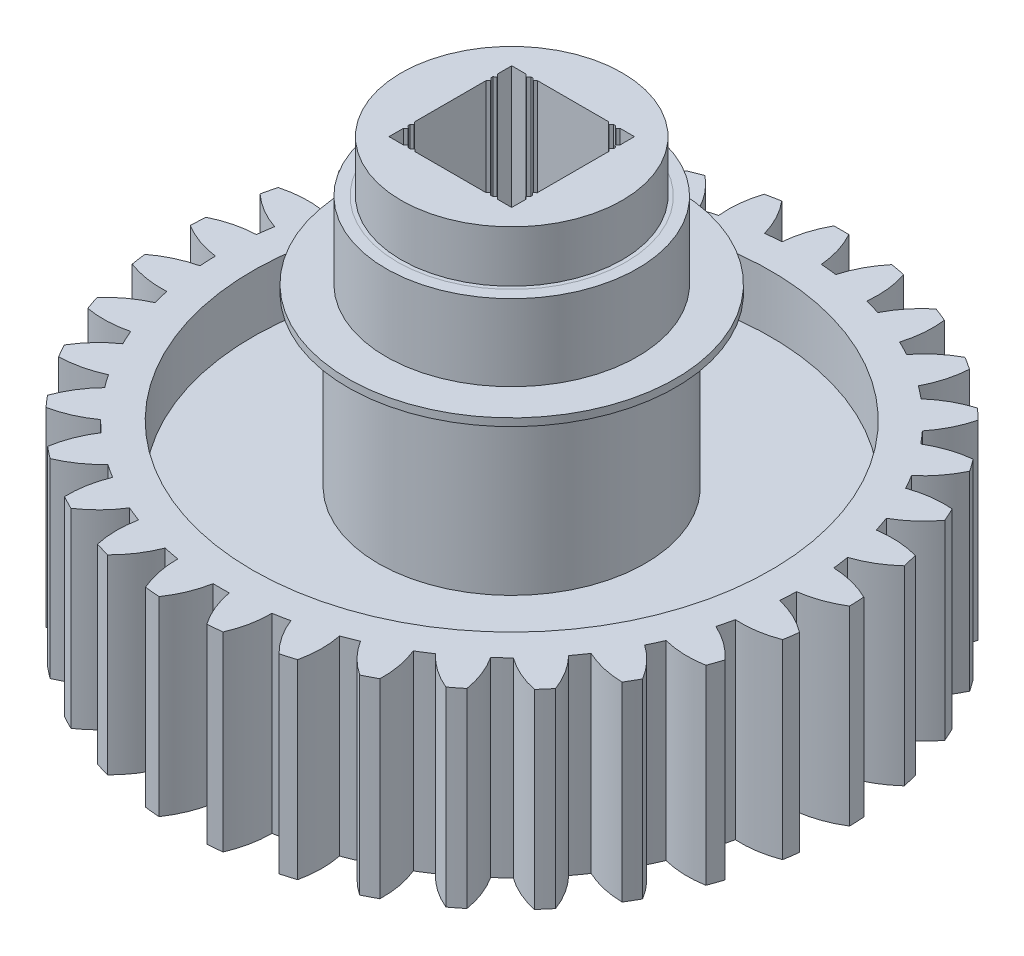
from build123d import *

# Parameters (mm, degrees)
SKETCH2_W            = 3.22
SKETCH2_H            = 3.22
CUT_EXTRUDE1_DEPTH   = 5.85
SKETCH3_R            = 1
EXTRUDE1_DEPTH       = 1.2
EXTRUDE2_DEPTH       = 5
CIRPATTERN1_COUNT    = 33
EXTRUDE3_START       = -5.85
EXTRUDE3_DEPTH       = 5.85
MIRROR2_START        = -5.85
MIRROR2_COPY_1_DEPTH = 5.85
MIRROR2_COPY_2_DEPTH = 5.85
SKETCH9_W            = 0.6
SKETCH9_H            = 1.8
CHAMFER1_SIZE        = 0.2


with BuildPart() as part:
    # Sketch1 → Revolve1 (revolve)
    with BuildSketch(Plane.XY, mode=Mode.PRIVATE) as revolve1_sk:
        Polygon((-2.3, 5.1), (-0.3, 5.1), (-0.3, 11.45), (-2.9, 11.45), (-2.9, 10.1), (-3, 10.1), (-3, 7.9), (-3.5, 7.9), (-3.5, 3.5), (-6.8, 3.5), (-6.8, 5), (-7.57, 5), (-7.57, 0), (-6.8, 0), (-6.8, 1.5), (-6, 1.5), (-6, -1.1), (-5, -1.1), (-5, 2.3), (-2.3, 2.3), align=None)
    revolve(revolve1_sk.sketch.rotate(Axis((0, 12.83176501, 0), (0, -1, 0)), 270), axis=Axis((0, 12.83176501, 0), (0, -1, 0)))

    # Sketch2 → Cut-Extrude1 (cut)
    with BuildSketch(Plane(origin=(0, 11.45, 0), x_dir=(1, 0, 0), z_dir=(0, 1, 0))):
        Rectangle(SKETCH2_W, SKETCH2_H)
    extrude(amount=-CUT_EXTRUDE1_DEPTH, mode=Mode.SUBTRACT)

    # Sketch3 → Extrude1 (add)
    with BuildSketch(Plane.XZ.offset(-2.3)):
        with Locations(Location((0, -3.4, 0), (0, 0, 270))):
            Circle(SKETCH3_R)
        with Locations(Location((0, 3.4, 0), (0, 0, 90))):
            Circle(SKETCH3_R)
        with BuildLine():
            Line((3, 3.322649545), (3, 4))
            ThreePointArc((3, 4), (5, 0), (3, -4))
            Line((3, -4), (3, -3.322649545))
            ThreePointArc((3, -3.322649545), (3.059460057, -2.982966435), (3.230769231, -2.683678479))
            ThreePointArc((3.230769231, -2.683678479), (4.2, 0), (3.230769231, 2.683678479))
            ThreePointArc((3.230769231, 2.683678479), (3.059460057, 2.982966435), (3, 3.322649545))
        make_face()
        with BuildLine():
            Line((-3, -4), (-3, -3.322649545))
            ThreePointArc((-3, -3.322649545), (-3.059460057, -2.982966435), (-3.230769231, -2.683678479))
            ThreePointArc((-3.230769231, -2.683678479), (-4.2, 0), (-3.230769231, 2.683678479))
            ThreePointArc((-3.230769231, 2.683678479), (-3.059460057, 2.982966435), (-3, 3.322649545))
            Line((-3, 3.322649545), (-3, 4))
            ThreePointArc((-3, 4), (-5, 0), (-3, -4))
        make_face()
    extrude(amount=EXTRUDE1_DEPTH)

    # Sketch4 → Extrude2 (add)
    with BuildSketch(Plane.XZ):
        with BuildLine():
            ThreePointArc((1.220907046, 7.470895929), (-0.001289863, 7.56999989), (-1.223452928, 7.470479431))
            ThreePointArc((-1.223452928, 7.470479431), (-1.175705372, 8.043187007), (-1.003777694, 8.591561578))
            ThreePointArc((-1.003777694, 8.591561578), (-0.815403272, 8.611481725), (-0.626637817, 8.627272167))
            ThreePointArc((-0.626637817, 8.627272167), (-0.36582475, 8.146575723), (-0.210907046, 7.622082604))
            ThreePointArc((-0.210907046, 7.622082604), (0, 7.625), (0.210907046, 7.622082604))
            ThreePointArc((0.210907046, 7.622082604), (0.36582475, 8.146575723), (0.626637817, 8.627272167))
            ThreePointArc((0.626637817, 8.627272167), (0.815102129, 8.611510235), (1.003176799, 8.591631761))
            ThreePointArc((1.003176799, 8.591631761), (1.174073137, 8.04331492), (1.220907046, 7.470895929))
        make_face()
    extrude2 = extrude(amount=-EXTRUDE2_DEPTH)

    # CirPattern1: Extrude2 ×33 about axis
    cirpattern1_axis = Axis((0, 0, 0), (0, 1, 0))
    for i in range(1, CIRPATTERN1_COUNT):
        add(extrude2.rotate(cirpattern1_axis, i * 360 / CIRPATTERN1_COUNT))

    # Sketch5 → Extrude3 (add)
    with BuildSketch(Plane(origin=(0, 11.45, 0), x_dir=(-1, 0, 0), z_dir=(0, 1, 0)).offset(EXTRUDE3_START)):
        with BuildLine():
            Line((-1.61, 1.064387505), (-1.61, 0.941000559))
            Line((-1.61, 0.941000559), (-1.551302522, 0.995356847))
            ThreePointArc((-1.551302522, 0.995356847), (-1.548097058, 1.002694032), (-1.551302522, 1.010031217))
            Line((-1.551302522, 1.010031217), (-1.61, 1.064387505))
        make_face()
        with BuildLine():
            Line((-1.551302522, -0.995356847), (-1.61, -0.941000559))
            Line((-1.61, -0.941000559), (-1.61, -1.064387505))
            Line((-1.61, -1.064387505), (-1.551302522, -1.010031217))
            ThreePointArc((-1.551302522, -1.010031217), (-1.548097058, -1.002694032), (-1.551302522, -0.995356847))
        make_face()
        with BuildLine():
            Line((-1.61, 1.23), (-1.61, 1.114387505))
            Line((-1.61, 1.114387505), (-1.54755002, 1.164387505))
            ThreePointArc((-1.54755002, 1.164387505), (-1.54380002, 1.172193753), (-1.54755002, 1.18))
            Line((-1.54755002, 1.18), (-1.61, 1.23))
        make_face()
        with BuildLine():
            Line((-1.54755002, -1.164387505), (-1.61, -1.114387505))
            Line((-1.61, -1.114387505), (-1.61, -1.23))
            Line((-1.61, -1.23), (-1.54755002, -1.18))
            ThreePointArc((-1.54755002, -1.18), (-1.54380002, -1.172193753), (-1.54755002, -1.164387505))
        make_face()
        with BuildLine():
            Line((-1.1078, 1.61), (-1.2348, 1.61))
            Line((-1.2348, 1.61), (-1.180295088, 1.5553146))
            ThreePointArc((-1.180295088, 1.5553146), (-1.1713, 1.55158), (-1.162304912, 1.5553146))
            Line((-1.162304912, 1.5553146), (-1.1078, 1.61))
        make_face()
        with BuildLine():
            Line((-0.93, 1.61), (-1.057, 1.61))
            Line((-1.057, 1.61), (-1.002495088, 1.5553146))
            ThreePointArc((-1.002495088, 1.5553146), (-0.9935, 1.55158), (-0.984504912, 1.5553146))
            Line((-0.984504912, 1.5553146), (-0.93, 1.61))
        make_face()
        with BuildLine():
            Line((1.180295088, 1.5553146), (1.2348, 1.61))
            Line((1.2348, 1.61), (1.1078, 1.61))
            Line((1.1078, 1.61), (1.162304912, 1.5553146))
            ThreePointArc((1.162304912, 1.5553146), (1.1713, 1.55158), (1.180295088, 1.5553146))
        make_face()
        with BuildLine():
            Line((1.057, 1.61), (0.93, 1.61))
            Line((0.93, 1.61), (0.984504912, 1.5553146))
            ThreePointArc((0.984504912, 1.5553146), (0.9935, 1.55158), (1.002495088, 1.5553146))
            Line((1.002495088, 1.5553146), (1.057, 1.61))
        make_face()
    extrude3 = extrude(amount=EXTRUDE3_DEPTH)

    # Mirror1: Extrude3 across plane
    add(extrude3.mirror(Plane.XY))

    # Mirror2 copy 1 sketch → Mirror2 copy 1 (add)
    with BuildSketch(Plane(origin=(0, 11.45, 0), x_dir=(1, 0, 0), z_dir=(0, 1, 0)).offset(MIRROR2_START)):
        with BuildLine():
            Line((-1.61, 1.064387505), (-1.61, 0.941000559))
            Line((-1.61, 0.941000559), (-1.551302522, 0.995356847))
            ThreePointArc((-1.551302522, 0.995356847), (-1.548097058, 1.002694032), (-1.551302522, 1.010031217))
            Line((-1.551302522, 1.010031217), (-1.61, 1.064387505))
        make_face()
        with BuildLine():
            Line((-1.551302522, -0.995356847), (-1.61, -0.941000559))
            Line((-1.61, -0.941000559), (-1.61, -1.064387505))
            Line((-1.61, -1.064387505), (-1.551302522, -1.010031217))
            ThreePointArc((-1.551302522, -1.010031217), (-1.548097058, -1.002694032), (-1.551302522, -0.995356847))
        make_face()
        with BuildLine():
            Line((-1.61, 1.23), (-1.61, 1.114387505))
            Line((-1.61, 1.114387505), (-1.54755002, 1.164387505))
            ThreePointArc((-1.54755002, 1.164387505), (-1.54380002, 1.172193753), (-1.54755002, 1.18))
            Line((-1.54755002, 1.18), (-1.61, 1.23))
        make_face()
        with BuildLine():
            Line((-1.54755002, -1.164387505), (-1.61, -1.114387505))
            Line((-1.61, -1.114387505), (-1.61, -1.23))
            Line((-1.61, -1.23), (-1.54755002, -1.18))
            ThreePointArc((-1.54755002, -1.18), (-1.54380002, -1.172193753), (-1.54755002, -1.164387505))
        make_face()
        with BuildLine():
            Line((-1.1078, 1.61), (-1.2348, 1.61))
            Line((-1.2348, 1.61), (-1.180295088, 1.5553146))
            ThreePointArc((-1.180295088, 1.5553146), (-1.1713, 1.55158), (-1.162304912, 1.5553146))
            Line((-1.162304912, 1.5553146), (-1.1078, 1.61))
        make_face()
        with BuildLine():
            Line((-0.93, 1.61), (-1.057, 1.61))
            Line((-1.057, 1.61), (-1.002495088, 1.5553146))
            ThreePointArc((-1.002495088, 1.5553146), (-0.9935, 1.55158), (-0.984504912, 1.5553146))
            Line((-0.984504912, 1.5553146), (-0.93, 1.61))
        make_face()
        with BuildLine():
            Line((1.180295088, 1.5553146), (1.2348, 1.61))
            Line((1.2348, 1.61), (1.1078, 1.61))
            Line((1.1078, 1.61), (1.162304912, 1.5553146))
            ThreePointArc((1.162304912, 1.5553146), (1.1713, 1.55158), (1.180295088, 1.5553146))
        make_face()
        with BuildLine():
            Line((1.057, 1.61), (0.93, 1.61))
            Line((0.93, 1.61), (0.984504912, 1.5553146))
            ThreePointArc((0.984504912, 1.5553146), (0.9935, 1.55158), (1.002495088, 1.5553146))
            Line((1.002495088, 1.5553146), (1.057, 1.61))
        make_face()
    extrude(amount=MIRROR2_COPY_1_DEPTH)

    # Mirror2 copy 2 sketch → Mirror2 copy 2 (add)
    with BuildSketch(Plane(origin=(0, 11.45, 0), x_dir=(1, 0, 0), z_dir=(0, 1, 0)).offset(MIRROR2_START)):
        with BuildLine():
            Line((-1.61, -1.064387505), (-1.61, -0.941000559))
            Line((-1.61, -0.941000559), (-1.551302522, -0.995356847))
            ThreePointArc((-1.551302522, -0.995356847), (-1.548097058, -1.002694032), (-1.551302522, -1.010031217))
            Line((-1.551302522, -1.010031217), (-1.61, -1.064387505))
        make_face()
        with BuildLine():
            Line((-1.551302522, 0.995356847), (-1.61, 0.941000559))
            Line((-1.61, 0.941000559), (-1.61, 1.064387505))
            Line((-1.61, 1.064387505), (-1.551302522, 1.010031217))
            ThreePointArc((-1.551302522, 1.010031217), (-1.548097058, 1.002694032), (-1.551302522, 0.995356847))
        make_face()
        with BuildLine():
            Line((-1.61, -1.23), (-1.61, -1.114387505))
            Line((-1.61, -1.114387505), (-1.54755002, -1.164387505))
            ThreePointArc((-1.54755002, -1.164387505), (-1.54380002, -1.172193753), (-1.54755002, -1.18))
            Line((-1.54755002, -1.18), (-1.61, -1.23))
        make_face()
        with BuildLine():
            Line((-1.54755002, 1.164387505), (-1.61, 1.114387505))
            Line((-1.61, 1.114387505), (-1.61, 1.23))
            Line((-1.61, 1.23), (-1.54755002, 1.18))
            ThreePointArc((-1.54755002, 1.18), (-1.54380002, 1.172193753), (-1.54755002, 1.164387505))
        make_face()
        with BuildLine():
            Line((-1.1078, -1.61), (-1.2348, -1.61))
            Line((-1.2348, -1.61), (-1.180295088, -1.5553146))
            ThreePointArc((-1.180295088, -1.5553146), (-1.1713, -1.55158), (-1.162304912, -1.5553146))
            Line((-1.162304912, -1.5553146), (-1.1078, -1.61))
        make_face()
        with BuildLine():
            Line((-0.93, -1.61), (-1.057, -1.61))
            Line((-1.057, -1.61), (-1.002495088, -1.5553146))
            ThreePointArc((-1.002495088, -1.5553146), (-0.9935, -1.55158), (-0.984504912, -1.5553146))
            Line((-0.984504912, -1.5553146), (-0.93, -1.61))
        make_face()
        with BuildLine():
            Line((1.180295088, -1.5553146), (1.2348, -1.61))
            Line((1.2348, -1.61), (1.1078, -1.61))
            Line((1.1078, -1.61), (1.162304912, -1.5553146))
            ThreePointArc((1.162304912, -1.5553146), (1.1713, -1.55158), (1.180295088, -1.5553146))
        make_face()
        with BuildLine():
            Line((1.057, -1.61), (0.93, -1.61))
            Line((0.93, -1.61), (0.984504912, -1.5553146))
            ThreePointArc((0.984504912, -1.5553146), (0.9935, -1.55158), (1.002495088, -1.5553146))
            Line((1.002495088, -1.5553146), (1.057, -1.61))
        make_face()
    extrude(amount=MIRROR2_COPY_2_DEPTH)


with BuildPart() as body_2:
    # Sketch8 → Revolve2 (revolve)
    with BuildSketch(Plane.XY, mode=Mode.PRIVATE) as revolve2_sk:
        Polygon((3, 10.1), (3, 7.9), (4.3, 7.9), (4.3, 8.1), (3.3, 8.1), (3.3, 10.1), align=None)
    revolve(revolve2_sk.sketch.rotate(Axis((0, 11.45, 0), (0, -1, 0)), 180), axis=Axis((0, 11.45, 0), (0, -1, 0)))


with BuildPart() as body_3:
    # Sketch9 → Revolve3 (revolve)
    with BuildSketch(Plane.XY, mode=Mode.PRIVATE) as revolve3_sk:
        with Locations((4.7, 0.2)):
            Rectangle(SKETCH9_W, SKETCH9_H)
    revolve(revolve3_sk.sketch.rotate(Axis((0, 2.3, 0), (0, -1, 0)), 90), axis=Axis((0, 2.3, 0), (0, -1, 0)))

    # Chamfer1
    chamfer1_edges = [body_3.edges().sort_by_distance(p)[0] for p in [
        (0, -0.7, -4.4),
    ]]
    chamfer(chamfer1_edges, length=CHAMFER1_SIZE)


solid = Compound([part.part, body_2.part, body_3.part])
